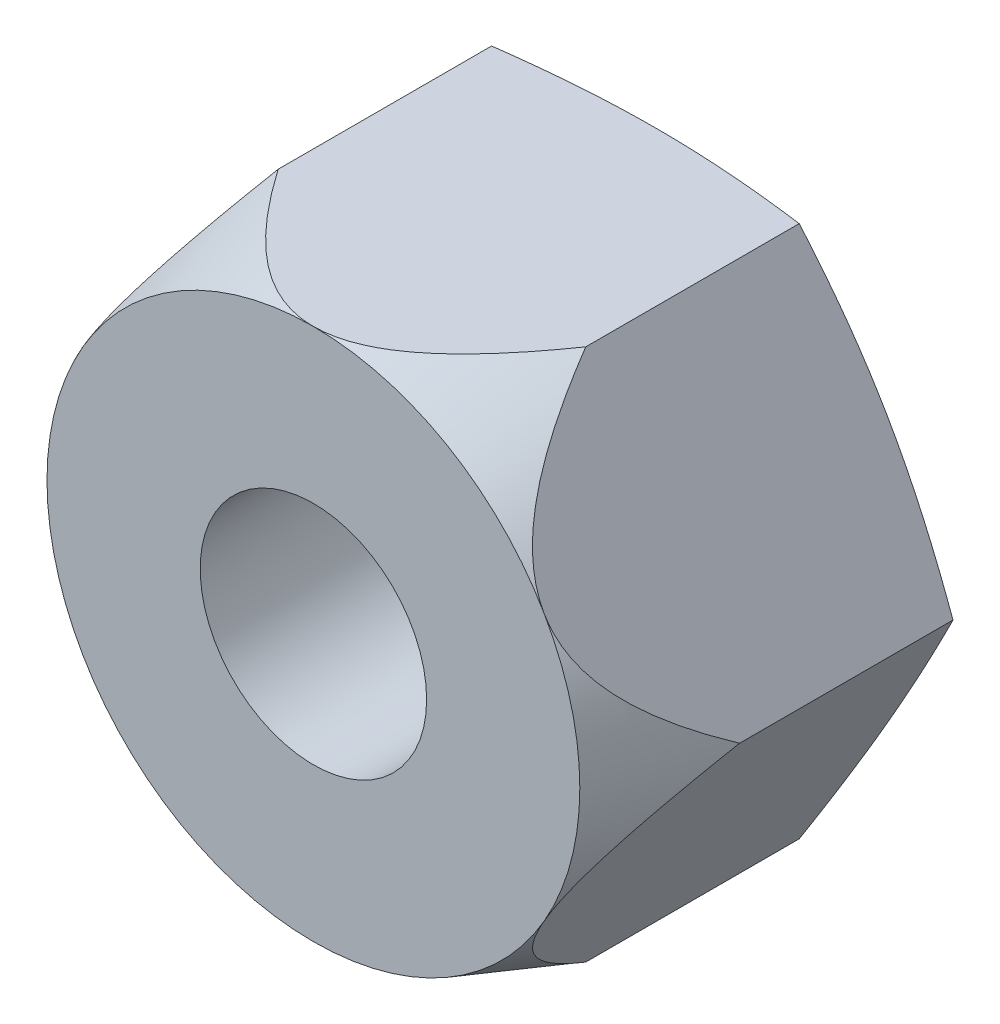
from build123d import *

# Parameters (mm, degrees)
BASENUT_DEPTH   = 5.3
SKETCH3_R       = 1.7
HOLE_DEPTH      = 9.088469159
ENDCHAMFER_SIZE = 0.485714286


with BuildPart() as part:
    # Sketch1 → BaseNut (new body)
    with BuildSketch(Plane.XY):
        Polygon((2.309401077, -4), (4.618802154, 0), (2.309401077, 4), (-2.309401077, 4), (-4.618802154, 0), (-2.309401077, -4), align=None)
    extrude(amount=-BASENUT_DEPTH)

    # Sketch2 → Double-Chamfer (revolve, cut)
    with BuildSketch(Plane(origin=(0.481162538, 0, -5.099964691), x_dir=(0, 0, -1), z_dir=(0, -1, 0)), mode=Mode.PRIVATE) as double_chamfer_sk:
        Polygon((-0.115823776, 4.137639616), (0.200035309, 4.137639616), (0.200035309, 2.958837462), align=None)
        Polygon((-5.099964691, 4.137639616), (-3.319964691, 4.137639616), (-5.099964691, 3.518837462), align=None)
    revolve(double_chamfer_sk.sketch.rotate(Axis((0, 0, -4.462865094), (0, 0, 1)), 179.999999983), axis=Axis((0, 0, -4.462865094), (0, 0, 1)), mode=Mode.SUBTRACT)

    # Sketch3 → Hole (cut, through all)
    with BuildSketch(Plane.XY):
        Circle(SKETCH3_R)
    extrude(amount=-HOLE_DEPTH, mode=Mode.SUBTRACT)

    # EndChamfer
    endchamfer_edges = [part.edges().sort_by_distance(p)[0] for p in [
        (-1.7, 0, -5.3),
    ]]
    chamfer(endchamfer_edges, length=ENDCHAMFER_SIZE)


solid = part.part
